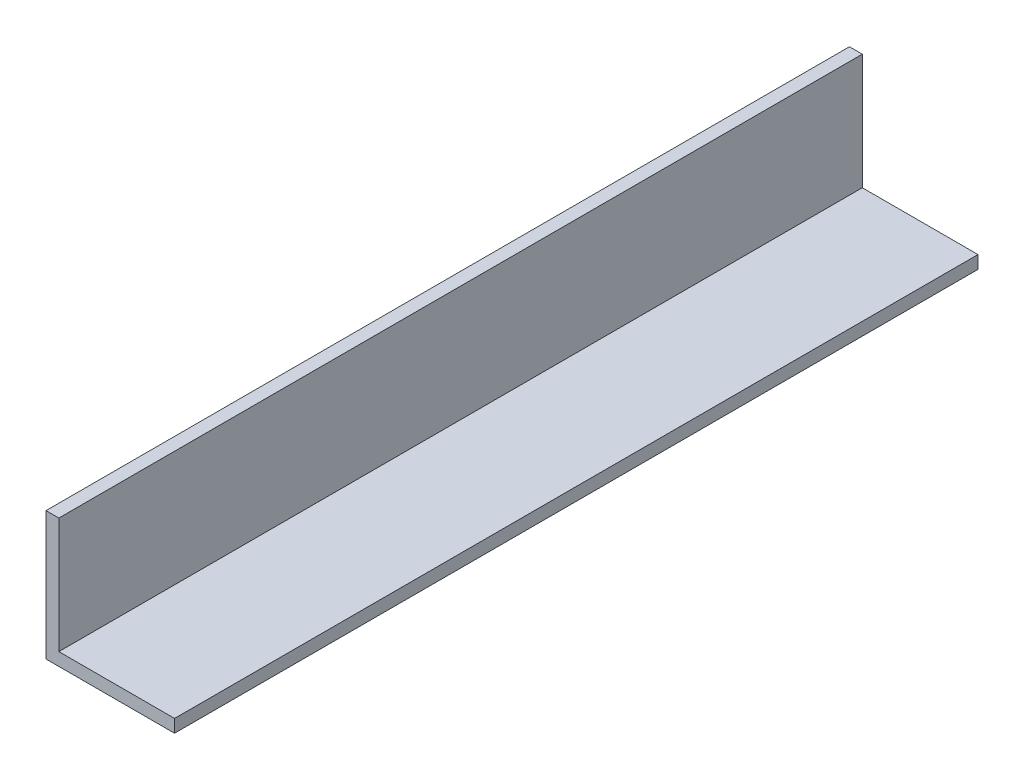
from build123d import *

# Parameters (mm, degrees)
BASE_EXTRUSION_DEPTH = 125


with BuildPart() as part:
    # Esquisse1 → Base-Extrusion (new, symmetric)
    with BuildSketch(Plane.XY):
        Polygon((0, 0), (0, 40), (4, 40), (4, 4), (40, 4), (40, 0), align=None)
    extrude(amount=BASE_EXTRUSION_DEPTH, both=True)


solid = part.part
